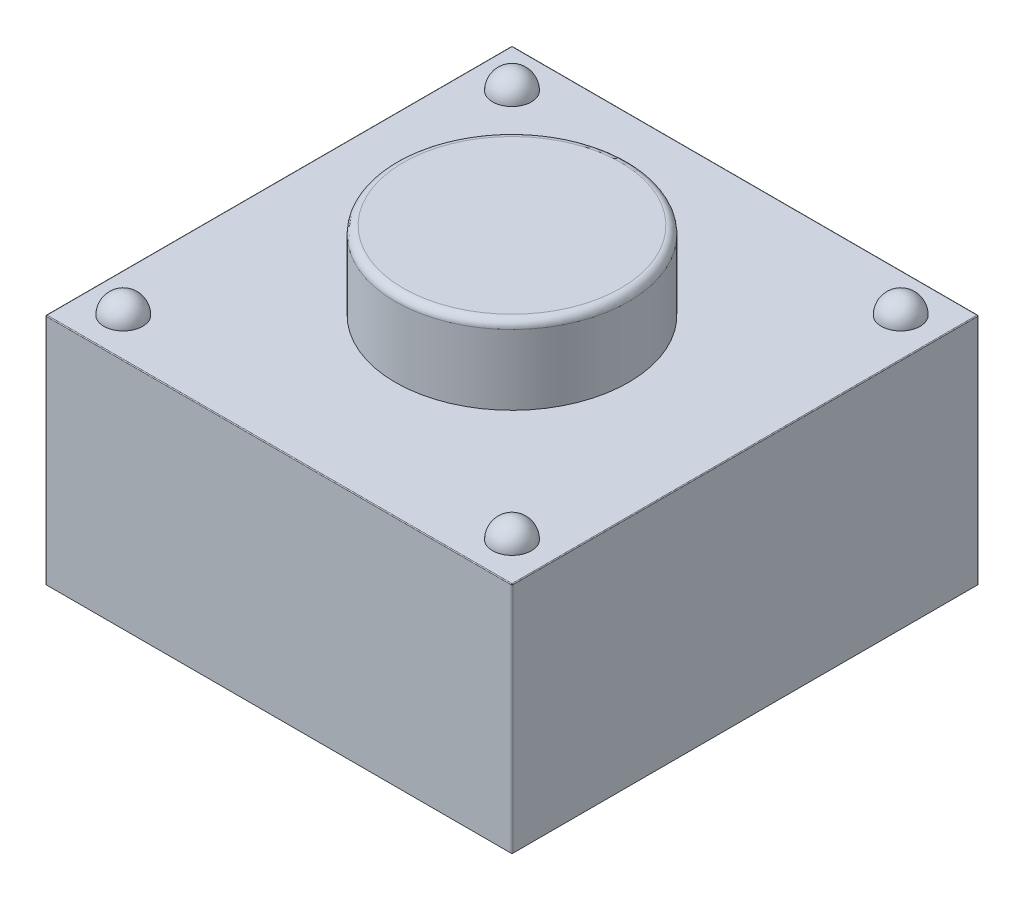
ISO-10303-21;
HEADER;
FILE_DESCRIPTION(('STEP AP214'),'2;1');
FILE_NAME('part.step','',(''),(''),'','','');
FILE_SCHEMA(('AUTOMOTIVE_DESIGN { 1 0 10303 214 1 1 1 1 }'));
ENDSEC;
DATA;
#1=APPLICATION_CONTEXT('core data for automotive mechanical design processes');
#2=APPLICATION_PROTOCOL_DEFINITION('international standard','automotive_design',2000,#1);
#3=PRODUCT_CONTEXT('',#1,'mechanical');
#4=PRODUCT('Part','Part','',(#3));
#5=PRODUCT_RELATED_PRODUCT_CATEGORY('part','',(#4));
#6=PRODUCT_DEFINITION_FORMATION('','',#4);
#7=PRODUCT_DEFINITION_CONTEXT('part definition',#1,'design');
#8=PRODUCT_DEFINITION('design','',#6,#7);
#9=PRODUCT_DEFINITION_SHAPE('','',#8);
#10=(LENGTH_UNIT() NAMED_UNIT(*) SI_UNIT(.MILLI.,.METRE.));
#11=(NAMED_UNIT(*) PLANE_ANGLE_UNIT() SI_UNIT($,.RADIAN.));
#12=(NAMED_UNIT(*) SI_UNIT($,.STERADIAN.) SOLID_ANGLE_UNIT());
#13=UNCERTAINTY_MEASURE_WITH_UNIT(LENGTH_MEASURE(1.E-05),#10,'distance_accuracy_value','');
#14=(GEOMETRIC_REPRESENTATION_CONTEXT(3) GLOBAL_UNCERTAINTY_ASSIGNED_CONTEXT((#13)) GLOBAL_UNIT_ASSIGNED_CONTEXT((#10,
#11,#12)) REPRESENTATION_CONTEXT('',''));
#15=CARTESIAN_POINT('',(0.,0.,0.));
#16=DIRECTION('',(0.,0.,1.));
#17=DIRECTION('',(1.,0.,0.));
#18=AXIS2_PLACEMENT_3D('',#15,#16,#17);
#19=CARTESIAN_POINT('',(0.,4.,0.));
#20=DIRECTION('',(0.,1.,0.));
#21=DIRECTION('',(0.,0.,1.));
#22=AXIS2_PLACEMENT_3D('',#19,#20,#21);
#23=PLANE('',#22);
#24=CARTESIAN_POINT('',(0.,4.,0.));
#25=DIRECTION('',(0.,-1.,0.));
#26=DIRECTION('',(1.,0.,0.));
#27=AXIS2_PLACEMENT_3D('',#24,#25,#26);
#28=CIRCLE('',#27,1.4);
#29=CARTESIAN_POINT('',(1.4,4.,0.));
#30=VERTEX_POINT('',#29);
#31=EDGE_CURVE('E216',#30,#30,#28,.T.);
#32=ORIENTED_EDGE('',*,*,#31,.F.);
#33=EDGE_LOOP('',(#32));
#34=FACE_BOUND('',#33,.T.);
#35=ADVANCED_FACE('F15',(#34),#23,.T.);
#36=CARTESIAN_POINT('',(0.,3.9,0.));
#37=DIRECTION('',(0.,1.,0.));
#38=DIRECTION('',(0.,0.,1.));
#39=AXIS2_PLACEMENT_3D('',#36,#37,#38);
#40=TOROIDAL_SURFACE('',#39,1.4,0.1);
#41=ORIENTED_EDGE('',*,*,#31,.T.);
#42=EDGE_LOOP('',(#41));
#43=FACE_BOUND('',#42,.T.);
#44=CARTESIAN_POINT('',(0.,3.9,0.));
#45=DIRECTION('',(0.,1.,0.));
#46=DIRECTION('',(0.,0.,1.));
#47=AXIS2_PLACEMENT_3D('',#44,#45,#46);
#48=CIRCLE('',#47,1.5);
#49=CARTESIAN_POINT('',(0.,3.9,1.5));
#50=VERTEX_POINT('',#49);
#51=EDGE_CURVE('E242',#50,#50,#48,.F.);
#52=ORIENTED_EDGE('',*,*,#51,.F.);
#53=EDGE_LOOP('',(#52));
#54=FACE_BOUND('',#53,.T.);
#55=ADVANCED_FACE('F222',(#43,#54),#40,.T.);
#56=CARTESIAN_POINT('',(0.,3.,0.));
#57=DIRECTION('',(0.,1.,0.));
#58=DIRECTION('',(0.,0.,1.));
#59=AXIS2_PLACEMENT_3D('',#56,#57,#58);
#60=CYLINDRICAL_SURFACE('',#59,1.5);
#61=ORIENTED_EDGE('',*,*,#51,.T.);
#62=EDGE_LOOP('',(#61));
#63=FACE_BOUND('',#62,.T.);
#64=CARTESIAN_POINT('',(0.,3.,0.));
#65=DIRECTION('',(0.,1.,0.));
#66=DIRECTION('',(0.,0.,1.));
#67=AXIS2_PLACEMENT_3D('',#64,#65,#66);
#68=CIRCLE('',#67,1.5);
#69=CARTESIAN_POINT('',(0.,3.,1.5));
#70=VERTEX_POINT('',#69);
#71=EDGE_CURVE('E19',#70,#70,#68,.F.);
#72=ORIENTED_EDGE('',*,*,#71,.F.);
#73=EDGE_LOOP('',(#72));
#74=FACE_BOUND('',#73,.T.);
#75=ADVANCED_FACE('F233',(#63,#74),#60,.T.);
#76=CARTESIAN_POINT('',(2.5,3.,2.5));
#77=DIRECTION('',(0.,0.,-1.));
#78=DIRECTION('',(-1.,0.,0.));
#79=AXIS2_PLACEMENT_3D('',#76,#77,#78);
#80=SPHERICAL_SURFACE('',#79,0.25);
#81=CARTESIAN_POINT('',(2.5,3.,2.5));
#82=DIRECTION('',(0.,-1.,0.));
#83=DIRECTION('',(0.,0.,-1.));
#84=AXIS2_PLACEMENT_3D('',#81,#82,#83);
#85=CIRCLE('',#84,0.25);
#86=CARTESIAN_POINT('',(2.5,3.,2.75));
#87=VERTEX_POINT('',#86);
#88=CARTESIAN_POINT('',(2.5,3.,2.25));
#89=VERTEX_POINT('',#88);
#90=EDGE_CURVE('E267',#87,#89,#85,.T.);
#91=ORIENTED_EDGE('',*,*,#90,.F.);
#92=CARTESIAN_POINT('',(2.75,3.,2.5));
#93=CARTESIAN_POINT('',(2.75001194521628,3.,2.5140645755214));
#94=CARTESIAN_POINT('',(2.74881384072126,3.,2.52812558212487));
#95=CARTESIAN_POINT('',(2.74408568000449,3.,2.55583908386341));
#96=CARTESIAN_POINT('',(2.74055745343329,3.,2.56949189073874));
#97=CARTESIAN_POINT('',(2.73125470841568,3.,2.59601727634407));
#98=CARTESIAN_POINT('',(2.72547911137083,3.,2.6088894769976));
#99=CARTESIAN_POINT('',(2.71185061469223,3.,2.63347947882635));
#100=CARTESIAN_POINT('',(2.70399808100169,3.,2.64519748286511));
#101=CARTESIAN_POINT('',(2.68643637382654,3.,2.66714997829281));
#102=CARTESIAN_POINT('',(2.67672702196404,3.,2.67738432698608));
#103=CARTESIAN_POINT('',(2.65572779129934,3.,2.69607758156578));
#104=CARTESIAN_POINT('',(2.64443793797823,3.,2.70453651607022));
#105=CARTESIAN_POINT('',(2.62059605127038,3.,2.7194410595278));
#106=CARTESIAN_POINT('',(2.60804363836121,3.,2.72588606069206));
#107=CARTESIAN_POINT('',(2.58203742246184,3.,2.73657387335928));
#108=CARTESIAN_POINT('',(2.56858415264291,3.,2.74081797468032));
#109=CARTESIAN_POINT('',(2.54587379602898,3.,2.74592878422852));
#110=CARTESIAN_POINT('',(2.53675957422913,3.,2.74745456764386));
#111=CARTESIAN_POINT('',(2.51843150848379,3.,2.74949004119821));
#112=CARTESIAN_POINT('',(2.50921782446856,3.,2.75000117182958));
#113=CARTESIAN_POINT('',(2.5,3.,2.75));
#114=B_SPLINE_CURVE_WITH_KNOTS('',3,(#92,#93,#94,#95,#96,#97,#98,#99,#100,#101,#102,#103,#104,
#105,#106,#107,#108,#109,#110,#111,#112,#113),.UNSPECIFIED.,.F.,.F.,(4,2,2,2,2,2,2,2,2,2,4),(0.,
0.042137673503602,0.0842422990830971,0.126367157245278,0.168484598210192,0.210606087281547,
0.252726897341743,0.294860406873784,0.33696919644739,0.364639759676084,0.39227101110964),.UNSPECIFIED.);
#115=CARTESIAN_POINT('',(2.75,3.,2.5));
#116=VERTEX_POINT('',#115);
#117=EDGE_CURVE('E34',#116,#87,#114,.T.);
#118=ORIENTED_EDGE('',*,*,#117,.F.);
#119=CARTESIAN_POINT('',(2.5,3.,2.5));
#120=DIRECTION('',(0.,-1.,0.));
#121=DIRECTION('',(0.,0.,-1.));
#122=AXIS2_PLACEMENT_3D('',#119,#120,#121);
#123=CIRCLE('',#122,0.25);
#124=EDGE_CURVE('E560',#89,#116,#123,.T.);
#125=ORIENTED_EDGE('',*,*,#124,.F.);
#126=EDGE_LOOP('',(#91,#118,#125));
#127=FACE_BOUND('',#126,.T.);
#128=ADVANCED_FACE('F251',(#127),#80,.T.);
#129=CARTESIAN_POINT('',(2.5,3.,-2.5));
#130=DIRECTION('',(0.,0.,-1.));
#131=DIRECTION('',(-1.,0.,0.));
#132=AXIS2_PLACEMENT_3D('',#129,#130,#131);
#133=SPHERICAL_SURFACE('',#132,0.25);
#134=CARTESIAN_POINT('',(2.5,3.,-2.5));
#135=DIRECTION('',(0.,-1.,0.));
#136=DIRECTION('',(0.,0.,-1.));
#137=AXIS2_PLACEMENT_3D('',#134,#135,#136);
#138=CIRCLE('',#137,0.25);
#139=CARTESIAN_POINT('',(2.5,3.,-2.25));
#140=VERTEX_POINT('',#139);
#141=CARTESIAN_POINT('',(2.5,3.,-2.75));
#142=VERTEX_POINT('',#141);
#143=EDGE_CURVE('E306',#140,#142,#138,.T.);
#144=ORIENTED_EDGE('',*,*,#143,.F.);
#145=CARTESIAN_POINT('',(2.75,3.,-2.5));
#146=CARTESIAN_POINT('',(2.75001194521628,3.,-2.4859354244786));
#147=CARTESIAN_POINT('',(2.74881384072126,3.,-2.47187441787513));
#148=CARTESIAN_POINT('',(2.74408568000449,3.,-2.44416091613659));
#149=CARTESIAN_POINT('',(2.74055745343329,3.,-2.43050810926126));
#150=CARTESIAN_POINT('',(2.73125470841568,3.,-2.40398272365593));
#151=CARTESIAN_POINT('',(2.72547911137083,3.,-2.3911105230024));
#152=CARTESIAN_POINT('',(2.71185061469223,3.,-2.36652052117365));
#153=CARTESIAN_POINT('',(2.70399808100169,3.,-2.35480251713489));
#154=CARTESIAN_POINT('',(2.68643637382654,3.,-2.33285002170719));
#155=CARTESIAN_POINT('',(2.67672702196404,3.,-2.32261567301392));
#156=CARTESIAN_POINT('',(2.65572779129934,3.,-2.30392241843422));
#157=CARTESIAN_POINT('',(2.64443793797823,3.,-2.29546348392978));
#158=CARTESIAN_POINT('',(2.62059605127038,3.,-2.2805589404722));
#159=CARTESIAN_POINT('',(2.60804363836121,3.,-2.27411393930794));
#160=CARTESIAN_POINT('',(2.58203742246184,3.,-2.26342612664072));
#161=CARTESIAN_POINT('',(2.56858415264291,3.,-2.25918202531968));
#162=CARTESIAN_POINT('',(2.54587379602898,3.,-2.25407121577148));
#163=CARTESIAN_POINT('',(2.53675957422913,3.,-2.25254543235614));
#164=CARTESIAN_POINT('',(2.51843150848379,3.,-2.25050995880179));
#165=CARTESIAN_POINT('',(2.50921782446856,3.,-2.24999882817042));
#166=CARTESIAN_POINT('',(2.5,3.,-2.25));
#167=B_SPLINE_CURVE_WITH_KNOTS('',3,(#145,#146,#147,#148,#149,#150,#151,#152,#153,#154,#155,
#156,#157,#158,#159,#160,#161,#162,#163,#164,#165,#166),.UNSPECIFIED.,.F.,.F.,(4,2,2,2,2,2,2,2,
2,2,4),(0.,0.042137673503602,0.0842422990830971,0.126367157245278,0.168484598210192,
0.210606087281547,0.252726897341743,0.294860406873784,0.33696919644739,0.364639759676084,
0.39227101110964),.UNSPECIFIED.);
#168=CARTESIAN_POINT('',(2.75,3.,-2.5));
#169=VERTEX_POINT('',#168);
#170=EDGE_CURVE('E300',#169,#140,#167,.T.);
#171=ORIENTED_EDGE('',*,*,#170,.F.);
#172=CARTESIAN_POINT('',(2.5,3.,-2.5));
#173=DIRECTION('',(0.,-1.,0.));
#174=DIRECTION('',(0.,0.,-1.));
#175=AXIS2_PLACEMENT_3D('',#172,#173,#174);
#176=CIRCLE('',#175,0.25);
#177=EDGE_CURVE('E266',#142,#169,#176,.T.);
#178=ORIENTED_EDGE('',*,*,#177,.F.);
#179=EDGE_LOOP('',(#144,#171,#178));
#180=FACE_BOUND('',#179,.T.);
#181=ADVANCED_FACE('F255',(#180),#133,.T.);
#182=CARTESIAN_POINT('',(-2.5,3.,2.5));
#183=DIRECTION('',(0.,0.,-1.));
#184=DIRECTION('',(-1.,0.,0.));
#185=AXIS2_PLACEMENT_3D('',#182,#183,#184);
#186=SPHERICAL_SURFACE('',#185,0.25);
#187=CARTESIAN_POINT('',(-2.5,3.,2.5));
#188=DIRECTION('',(0.,1.,0.));
#189=DIRECTION('',(0.,0.,-1.));
#190=AXIS2_PLACEMENT_3D('',#187,#188,#189);
#191=CIRCLE('',#190,0.25);
#192=CARTESIAN_POINT('',(-2.5,3.,2.25));
#193=VERTEX_POINT('',#192);
#194=CARTESIAN_POINT('',(-2.5,3.,2.75));
#195=VERTEX_POINT('',#194);
#196=EDGE_CURVE('E380',#193,#195,#191,.F.);
#197=ORIENTED_EDGE('',*,*,#196,.F.);
#198=CARTESIAN_POINT('',(-2.75,3.,2.5));
#199=CARTESIAN_POINT('',(-2.75001194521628,3.,2.4859354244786));
#200=CARTESIAN_POINT('',(-2.74881384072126,3.,2.47187441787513));
#201=CARTESIAN_POINT('',(-2.74408568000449,3.,2.44416091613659));
#202=CARTESIAN_POINT('',(-2.74055745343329,3.,2.43050810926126));
#203=CARTESIAN_POINT('',(-2.73125470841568,3.,2.40398272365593));
#204=CARTESIAN_POINT('',(-2.72547911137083,3.,2.3911105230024));
#205=CARTESIAN_POINT('',(-2.71185061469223,3.,2.36652052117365));
#206=CARTESIAN_POINT('',(-2.70399808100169,3.,2.35480251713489));
#207=CARTESIAN_POINT('',(-2.68643637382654,3.,2.33285002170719));
#208=CARTESIAN_POINT('',(-2.67672702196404,3.,2.32261567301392));
#209=CARTESIAN_POINT('',(-2.65572779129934,3.,2.30392241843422));
#210=CARTESIAN_POINT('',(-2.64443793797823,3.,2.29546348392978));
#211=CARTESIAN_POINT('',(-2.62059605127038,3.,2.2805589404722));
#212=CARTESIAN_POINT('',(-2.60804363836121,3.,2.27411393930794));
#213=CARTESIAN_POINT('',(-2.58203742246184,3.,2.26342612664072));
#214=CARTESIAN_POINT('',(-2.56858415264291,3.,2.25918202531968));
#215=CARTESIAN_POINT('',(-2.54587379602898,3.,2.25407121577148));
#216=CARTESIAN_POINT('',(-2.53675957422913,3.,2.25254543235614));
#217=CARTESIAN_POINT('',(-2.51843150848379,3.,2.25050995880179));
#218=CARTESIAN_POINT('',(-2.50921782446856,3.,2.24999882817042));
#219=CARTESIAN_POINT('',(-2.5,3.,2.25));
#220=B_SPLINE_CURVE_WITH_KNOTS('',3,(#198,#199,#200,#201,#202,#203,#204,#205,#206,#207,#208,
#209,#210,#211,#212,#213,#214,#215,#216,#217,#218,#219),.UNSPECIFIED.,.F.,.F.,(4,2,2,2,2,2,2,2,
2,2,4),(0.,0.042137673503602,0.0842422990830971,0.126367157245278,0.168484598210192,
0.210606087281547,0.252726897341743,0.294860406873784,0.33696919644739,0.364639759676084,
0.39227101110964),.UNSPECIFIED.);
#221=CARTESIAN_POINT('',(-2.75,3.,2.5));
#222=VERTEX_POINT('',#221);
#223=EDGE_CURVE('E293',#222,#193,#220,.T.);
#224=ORIENTED_EDGE('',*,*,#223,.F.);
#225=CARTESIAN_POINT('',(-2.5,3.,2.5));
#226=DIRECTION('',(0.,1.,0.));
#227=DIRECTION('',(0.,0.,-1.));
#228=AXIS2_PLACEMENT_3D('',#225,#226,#227);
#229=CIRCLE('',#228,0.25);
#230=EDGE_CURVE('E305',#195,#222,#229,.F.);
#231=ORIENTED_EDGE('',*,*,#230,.F.);
#232=EDGE_LOOP('',(#197,#224,#231));
#233=FACE_BOUND('',#232,.T.);
#234=ADVANCED_FACE('F313',(#233),#186,.T.);
#235=CARTESIAN_POINT('',(-2.5,3.,-2.5));
#236=DIRECTION('',(0.,0.,-1.));
#237=DIRECTION('',(-1.,0.,0.));
#238=AXIS2_PLACEMENT_3D('',#235,#236,#237);
#239=SPHERICAL_SURFACE('',#238,0.25);
#240=CARTESIAN_POINT('',(-2.5,3.,-2.5));
#241=DIRECTION('',(0.,1.,0.));
#242=DIRECTION('',(0.,0.,-1.));
#243=AXIS2_PLACEMENT_3D('',#240,#241,#242);
#244=CIRCLE('',#243,0.25);
#245=CARTESIAN_POINT('',(-2.5,3.,-2.75));
#246=VERTEX_POINT('',#245);
#247=CARTESIAN_POINT('',(-2.5,3.,-2.25));
#248=VERTEX_POINT('',#247);
#249=EDGE_CURVE('E378',#246,#248,#244,.F.);
#250=ORIENTED_EDGE('',*,*,#249,.F.);
#251=CARTESIAN_POINT('',(-2.75,3.,-2.5));
#252=CARTESIAN_POINT('',(-2.75001194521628,3.,-2.5140645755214));
#253=CARTESIAN_POINT('',(-2.74881384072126,3.,-2.52812558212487));
#254=CARTESIAN_POINT('',(-2.74408568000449,3.,-2.55583908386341));
#255=CARTESIAN_POINT('',(-2.74055745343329,3.,-2.56949189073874));
#256=CARTESIAN_POINT('',(-2.73125470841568,3.,-2.59601727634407));
#257=CARTESIAN_POINT('',(-2.72547911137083,3.,-2.6088894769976));
#258=CARTESIAN_POINT('',(-2.71185061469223,3.,-2.63347947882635));
#259=CARTESIAN_POINT('',(-2.70399808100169,3.,-2.64519748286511));
#260=CARTESIAN_POINT('',(-2.68643637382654,3.,-2.66714997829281));
#261=CARTESIAN_POINT('',(-2.67672702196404,3.,-2.67738432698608));
#262=CARTESIAN_POINT('',(-2.65572779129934,3.,-2.69607758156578));
#263=CARTESIAN_POINT('',(-2.64443793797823,3.,-2.70453651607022));
#264=CARTESIAN_POINT('',(-2.62059605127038,3.,-2.7194410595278));
#265=CARTESIAN_POINT('',(-2.60804363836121,3.,-2.72588606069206));
#266=CARTESIAN_POINT('',(-2.58203742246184,3.,-2.73657387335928));
#267=CARTESIAN_POINT('',(-2.56858415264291,3.,-2.74081797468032));
#268=CARTESIAN_POINT('',(-2.54587379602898,3.,-2.74592878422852));
#269=CARTESIAN_POINT('',(-2.53675957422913,3.,-2.74745456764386));
#270=CARTESIAN_POINT('',(-2.51843150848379,3.,-2.74949004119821));
#271=CARTESIAN_POINT('',(-2.50921782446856,3.,-2.75000117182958));
#272=CARTESIAN_POINT('',(-2.5,3.,-2.75));
#273=B_SPLINE_CURVE_WITH_KNOTS('',3,(#251,#252,#253,#254,#255,#256,#257,#258,#259,#260,#261,
#262,#263,#264,#265,#266,#267,#268,#269,#270,#271,#272),.UNSPECIFIED.,.F.,.F.,(4,2,2,2,2,2,2,2,
2,2,4),(0.,0.042137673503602,0.0842422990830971,0.126367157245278,0.168484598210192,
0.210606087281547,0.252726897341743,0.294860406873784,0.33696919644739,0.364639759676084,
0.39227101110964),.UNSPECIFIED.);
#274=CARTESIAN_POINT('',(-2.75,3.,-2.5));
#275=VERTEX_POINT('',#274);
#276=EDGE_CURVE('E284',#275,#246,#273,.T.);
#277=ORIENTED_EDGE('',*,*,#276,.F.);
#278=CARTESIAN_POINT('',(-2.5,3.,-2.5));
#279=DIRECTION('',(0.,1.,0.));
#280=DIRECTION('',(0.,0.,-1.));
#281=AXIS2_PLACEMENT_3D('',#278,#279,#280);
#282=CIRCLE('',#281,0.25);
#283=EDGE_CURVE('E379',#248,#275,#282,.F.);
#284=ORIENTED_EDGE('',*,*,#283,.F.);
#285=EDGE_LOOP('',(#250,#277,#284));
#286=FACE_BOUND('',#285,.T.);
#287=ADVANCED_FACE('F140',(#286),#239,.T.);
#288=CARTESIAN_POINT('',(-2.99,2.99,2.99));
#289=DIRECTION('',(-0.577350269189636,0.577350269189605,0.577350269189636));
#290=DIRECTION('',(-0.707106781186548,0.,-0.707106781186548));
#291=AXIS2_PLACEMENT_3D('',#288,#289,#290);
#292=SPHERICAL_SURFACE('',#291,0.01);
#293=CARTESIAN_POINT('',(-2.9957735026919,2.9957735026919,2.9957735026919));
#294=VERTEX_POINT('',#293);
#295=VERTEX_LOOP('',#294);
#296=FACE_BOUND('',#295,.T.);
#297=CARTESIAN_POINT('',(-2.99,2.99,2.99));
#298=DIRECTION('',(0.,1.,0.));
#299=DIRECTION('',(0.,0.,1.));
#300=AXIS2_PLACEMENT_3D('',#297,#298,#299);
#301=CIRCLE('',#300,0.01);
#302=CARTESIAN_POINT('',(-2.99,2.99,3.));
#303=VERTEX_POINT('',#302);
#304=CARTESIAN_POINT('',(-3.,2.99,2.99));
#305=VERTEX_POINT('',#304);
#306=EDGE_CURVE('E145',#303,#305,#301,.F.);
#307=ORIENTED_EDGE('',*,*,#306,.F.);
#308=CARTESIAN_POINT('',(-2.99,2.99,2.99));
#309=DIRECTION('',(1.,0.,0.));
#310=DIRECTION('',(0.,0.,-1.));
#311=AXIS2_PLACEMENT_3D('',#308,#309,#310);
#312=CIRCLE('',#311,0.01);
#313=CARTESIAN_POINT('',(-2.99,3.,2.99));
#314=VERTEX_POINT('',#313);
#315=EDGE_CURVE('E147',#314,#303,#312,.T.);
#316=ORIENTED_EDGE('',*,*,#315,.F.);
#317=CARTESIAN_POINT('',(-2.99,2.99,2.99));
#318=DIRECTION('',(0.,0.,1.));
#319=DIRECTION('',(1.,0.,0.));
#320=AXIS2_PLACEMENT_3D('',#317,#318,#319);
#321=CIRCLE('',#320,0.01);
#322=EDGE_CURVE('E149',#305,#314,#321,.F.);
#323=ORIENTED_EDGE('',*,*,#322,.F.);
#324=EDGE_LOOP('',(#307,#316,#323));
#325=FACE_BOUND('',#324,.T.);
#326=ADVANCED_FACE('F136',(#296,#325),#292,.T.);
#327=CARTESIAN_POINT('',(2.99,2.99,2.99));
#328=DIRECTION('',(0.577350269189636,0.577350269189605,0.577350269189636));
#329=DIRECTION('',(-0.707106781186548,0.,0.707106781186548));
#330=AXIS2_PLACEMENT_3D('',#327,#328,#329);
#331=SPHERICAL_SURFACE('',#330,0.01);
#332=CARTESIAN_POINT('',(2.9957735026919,2.9957735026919,2.9957735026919));
#333=VERTEX_POINT('',#332);
#334=VERTEX_LOOP('',#333);
#335=FACE_BOUND('',#334,.T.);
#336=CARTESIAN_POINT('',(2.99,2.99,2.99));
#337=DIRECTION('',(0.,1.,0.));
#338=DIRECTION('',(0.,0.,1.));
#339=AXIS2_PLACEMENT_3D('',#336,#337,#338);
#340=CIRCLE('',#339,0.01);
#341=CARTESIAN_POINT('',(3.,2.99,2.99));
#342=VERTEX_POINT('',#341);
#343=CARTESIAN_POINT('',(2.99,2.99,3.));
#344=VERTEX_POINT('',#343);
#345=EDGE_CURVE('E394',#342,#344,#340,.F.);
#346=ORIENTED_EDGE('',*,*,#345,.F.);
#347=CARTESIAN_POINT('',(2.99,2.99,2.99));
#348=DIRECTION('',(0.,0.,-1.));
#349=DIRECTION('',(-1.,0.,0.));
#350=AXIS2_PLACEMENT_3D('',#347,#348,#349);
#351=CIRCLE('',#350,0.01);
#352=CARTESIAN_POINT('',(2.99,3.,2.99));
#353=VERTEX_POINT('',#352);
#354=EDGE_CURVE('E205',#353,#342,#351,.T.);
#355=ORIENTED_EDGE('',*,*,#354,.F.);
#356=CARTESIAN_POINT('',(2.99,2.99,2.99));
#357=DIRECTION('',(1.,0.,0.));
#358=DIRECTION('',(0.,0.,-1.));
#359=AXIS2_PLACEMENT_3D('',#356,#357,#358);
#360=CIRCLE('',#359,0.01);
#361=EDGE_CURVE('E155',#344,#353,#360,.F.);
#362=ORIENTED_EDGE('',*,*,#361,.F.);
#363=EDGE_LOOP('',(#346,#355,#362));
#364=FACE_BOUND('',#363,.T.);
#365=ADVANCED_FACE('F139',(#335,#364),#331,.T.);
#366=CARTESIAN_POINT('',(-2.99,2.99,-2.99));
#367=DIRECTION('',(-0.577350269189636,0.577350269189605,-0.577350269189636));
#368=DIRECTION('',(0.707106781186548,0.,-0.707106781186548));
#369=AXIS2_PLACEMENT_3D('',#366,#367,#368);
#370=SPHERICAL_SURFACE('',#369,0.01);
#371=CARTESIAN_POINT('',(-2.9957735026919,2.9957735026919,-2.9957735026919));
#372=VERTEX_POINT('',#371);
#373=VERTEX_LOOP('',#372);
#374=FACE_BOUND('',#373,.T.);
#375=CARTESIAN_POINT('',(-2.99,2.99,-2.99));
#376=DIRECTION('',(0.,1.,0.));
#377=DIRECTION('',(0.,0.,1.));
#378=AXIS2_PLACEMENT_3D('',#375,#376,#377);
#379=CIRCLE('',#378,0.01);
#380=CARTESIAN_POINT('',(-3.,2.99,-2.99));
#381=VERTEX_POINT('',#380);
#382=CARTESIAN_POINT('',(-2.99,2.99,-3.));
#383=VERTEX_POINT('',#382);
#384=EDGE_CURVE('E397',#381,#383,#379,.F.);
#385=ORIENTED_EDGE('',*,*,#384,.F.);
#386=CARTESIAN_POINT('',(-2.99,2.99,-2.99));
#387=DIRECTION('',(0.,0.,1.));
#388=DIRECTION('',(1.,0.,0.));
#389=AXIS2_PLACEMENT_3D('',#386,#387,#388);
#390=CIRCLE('',#389,0.01);
#391=CARTESIAN_POINT('',(-2.99,3.,-2.99));
#392=VERTEX_POINT('',#391);
#393=EDGE_CURVE('E211',#392,#381,#390,.T.);
#394=ORIENTED_EDGE('',*,*,#393,.F.);
#395=CARTESIAN_POINT('',(-2.99,2.99,-2.99));
#396=DIRECTION('',(-1.,0.,0.));
#397=DIRECTION('',(0.,0.,1.));
#398=AXIS2_PLACEMENT_3D('',#395,#396,#397);
#399=CIRCLE('',#398,0.01);
#400=EDGE_CURVE('E201',#383,#392,#399,.F.);
#401=ORIENTED_EDGE('',*,*,#400,.F.);
#402=EDGE_LOOP('',(#385,#394,#401));
#403=FACE_BOUND('',#402,.T.);
#404=ADVANCED_FACE('F275',(#374,#403),#370,.T.);
#405=CARTESIAN_POINT('',(0.,3.,0.));
#406=DIRECTION('',(0.,1.,0.));
#407=DIRECTION('',(0.,0.,1.));
#408=AXIS2_PLACEMENT_3D('',#405,#406,#407);
#409=PLANE('',#408);
#410=ORIENTED_EDGE('',*,*,#276,.T.);
#411=ORIENTED_EDGE('',*,*,#249,.T.);
#412=ORIENTED_EDGE('',*,*,#283,.T.);
#413=EDGE_LOOP('',(#410,#411,#412));
#414=FACE_BOUND('',#413,.T.);
#415=ORIENTED_EDGE('',*,*,#223,.T.);
#416=ORIENTED_EDGE('',*,*,#196,.T.);
#417=ORIENTED_EDGE('',*,*,#230,.T.);
#418=EDGE_LOOP('',(#415,#416,#417));
#419=FACE_BOUND('',#418,.T.);
#420=ORIENTED_EDGE('',*,*,#170,.T.);
#421=ORIENTED_EDGE('',*,*,#143,.T.);
#422=ORIENTED_EDGE('',*,*,#177,.T.);
#423=EDGE_LOOP('',(#420,#421,#422));
#424=FACE_BOUND('',#423,.T.);
#425=ORIENTED_EDGE('',*,*,#117,.T.);
#426=ORIENTED_EDGE('',*,*,#90,.T.);
#427=ORIENTED_EDGE('',*,*,#124,.T.);
#428=EDGE_LOOP('',(#425,#426,#427));
#429=FACE_BOUND('',#428,.T.);
#430=ORIENTED_EDGE('',*,*,#71,.T.);
#431=EDGE_LOOP('',(#430));
#432=FACE_BOUND('',#431,.T.);
#433=DIRECTION('',(1.,0.,0.));
#434=VECTOR('',#433,1.);
#435=CARTESIAN_POINT('',(-1.5,3.,2.99));
#436=LINE('',#435,#434);
#437=EDGE_CURVE('E207',#353,#314,#436,.F.);
#438=ORIENTED_EDGE('',*,*,#437,.F.);
#439=DIRECTION('',(0.,0.,-1.));
#440=VECTOR('',#439,1.);
#441=CARTESIAN_POINT('',(2.99,3.,1.5));
#442=LINE('',#441,#440);
#443=CARTESIAN_POINT('',(2.99,3.,-2.99));
#444=VERTEX_POINT('',#443);
#445=EDGE_CURVE('E202',#444,#353,#442,.F.);
#446=ORIENTED_EDGE('',*,*,#445,.F.);
#447=DIRECTION('',(-1.,0.,0.));
#448=VECTOR('',#447,1.);
#449=CARTESIAN_POINT('',(1.5,3.,-2.99));
#450=LINE('',#449,#448);
#451=EDGE_CURVE('E197',#392,#444,#450,.F.);
#452=ORIENTED_EDGE('',*,*,#451,.F.);
#453=DIRECTION('',(0.,0.,1.));
#454=VECTOR('',#453,1.);
#455=CARTESIAN_POINT('',(-2.99,3.,-1.5));
#456=LINE('',#455,#454);
#457=EDGE_CURVE('E209',#314,#392,#456,.F.);
#458=ORIENTED_EDGE('',*,*,#457,.F.);
#459=EDGE_LOOP('',(#438,#446,#452,#458));
#460=FACE_BOUND('',#459,.T.);
#461=ADVANCED_FACE('F269',(#414,#419,#424,#429,#432,#460),#409,.T.);
#462=CARTESIAN_POINT('',(2.99,2.99,-2.99));
#463=DIRECTION('',(0.577350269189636,0.577350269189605,-0.577350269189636));
#464=DIRECTION('',(0.707106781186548,0.,0.707106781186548));
#465=AXIS2_PLACEMENT_3D('',#462,#463,#464);
#466=SPHERICAL_SURFACE('',#465,0.01);
#467=CARTESIAN_POINT('',(2.9957735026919,2.9957735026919,-2.9957735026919));
#468=VERTEX_POINT('',#467);
#469=VERTEX_LOOP('',#468);
#470=FACE_BOUND('',#469,.T.);
#471=CARTESIAN_POINT('',(2.99,2.99,-2.99));
#472=DIRECTION('',(0.,1.,0.));
#473=DIRECTION('',(0.,0.,1.));
#474=AXIS2_PLACEMENT_3D('',#471,#472,#473);
#475=CIRCLE('',#474,0.01);
#476=CARTESIAN_POINT('',(2.99,2.99,-3.));
#477=VERTEX_POINT('',#476);
#478=CARTESIAN_POINT('',(3.,2.99,-2.99));
#479=VERTEX_POINT('',#478);
#480=EDGE_CURVE('E186',#477,#479,#475,.F.);
#481=ORIENTED_EDGE('',*,*,#480,.F.);
#482=CARTESIAN_POINT('',(2.99,2.99,-2.99));
#483=DIRECTION('',(-1.,0.,0.));
#484=DIRECTION('',(0.,0.,1.));
#485=AXIS2_PLACEMENT_3D('',#482,#483,#484);
#486=CIRCLE('',#485,0.01);
#487=EDGE_CURVE('E200',#444,#477,#486,.T.);
#488=ORIENTED_EDGE('',*,*,#487,.F.);
#489=CARTESIAN_POINT('',(2.99,2.99,-2.99));
#490=DIRECTION('',(0.,0.,-1.));
#491=DIRECTION('',(-1.,0.,0.));
#492=AXIS2_PLACEMENT_3D('',#489,#490,#491);
#493=CIRCLE('',#492,0.01);
#494=EDGE_CURVE('E206',#479,#444,#493,.F.);
#495=ORIENTED_EDGE('',*,*,#494,.F.);
#496=EDGE_LOOP('',(#481,#488,#495));
#497=FACE_BOUND('',#496,.T.);
#498=ADVANCED_FACE('F274',(#470,#497),#466,.T.);
#499=CARTESIAN_POINT('',(-2.99,2.99,-1.5));
#500=DIRECTION('',(0.,0.,1.));
#501=DIRECTION('',(1.,0.,0.));
#502=AXIS2_PLACEMENT_3D('',#499,#500,#501);
#503=CYLINDRICAL_SURFACE('',#502,0.01);
#504=ORIENTED_EDGE('',*,*,#393,.T.);
#505=DIRECTION('',(0.,0.,1.));
#506=VECTOR('',#505,1.);
#507=CARTESIAN_POINT('',(-3.,2.99,-3.));
#508=LINE('',#507,#506);
#509=EDGE_CURVE('E174',#305,#381,#508,.F.);
#510=ORIENTED_EDGE('',*,*,#509,.F.);
#511=ORIENTED_EDGE('',*,*,#322,.T.);
#512=ORIENTED_EDGE('',*,*,#457,.T.);
#513=EDGE_LOOP('',(#504,#510,#511,#512));
#514=FACE_BOUND('',#513,.T.);
#515=ADVANCED_FACE('F433',(#514),#503,.T.);
#516=CARTESIAN_POINT('',(-2.99,0.,2.99));
#517=DIRECTION('',(0.,1.,0.));
#518=DIRECTION('',(0.,0.,1.));
#519=AXIS2_PLACEMENT_3D('',#516,#517,#518);
#520=CYLINDRICAL_SURFACE('',#519,0.01);
#521=ORIENTED_EDGE('',*,*,#306,.T.);
#522=DIRECTION('',(0.,1.,0.));
#523=VECTOR('',#522,1.);
#524=CARTESIAN_POINT('',(-3.,0.,2.99));
#525=LINE('',#524,#523);
#526=CARTESIAN_POINT('',(-3.,0.,2.99));
#527=VERTEX_POINT('',#526);
#528=EDGE_CURVE('E178',#527,#305,#525,.T.);
#529=ORIENTED_EDGE('',*,*,#528,.F.);
#530=CARTESIAN_POINT('',(-2.99,0.,2.99));
#531=DIRECTION('',(0.,1.,0.));
#532=DIRECTION('',(0.,0.,1.));
#533=AXIS2_PLACEMENT_3D('',#530,#531,#532);
#534=CIRCLE('',#533,0.01);
#535=CARTESIAN_POINT('',(-2.99,0.,3.));
#536=VERTEX_POINT('',#535);
#537=EDGE_CURVE('E156',#527,#536,#534,.T.);
#538=ORIENTED_EDGE('',*,*,#537,.T.);
#539=DIRECTION('',(0.,1.,0.));
#540=VECTOR('',#539,1.);
#541=CARTESIAN_POINT('',(-2.99,0.,3.));
#542=LINE('',#541,#540);
#543=EDGE_CURVE('E165',#303,#536,#542,.F.);
#544=ORIENTED_EDGE('',*,*,#543,.F.);
#545=EDGE_LOOP('',(#521,#529,#538,#544));
#546=FACE_BOUND('',#545,.T.);
#547=ADVANCED_FACE('F173',(#546),#520,.T.);
#548=CARTESIAN_POINT('',(-1.5,2.99,2.99));
#549=DIRECTION('',(1.,0.,0.));
#550=DIRECTION('',(0.,0.,-1.));
#551=AXIS2_PLACEMENT_3D('',#548,#549,#550);
#552=CYLINDRICAL_SURFACE('',#551,0.01);
#553=ORIENTED_EDGE('',*,*,#315,.T.);
#554=DIRECTION('',(1.,0.,0.));
#555=VECTOR('',#554,1.);
#556=CARTESIAN_POINT('',(-3.,2.99,3.));
#557=LINE('',#556,#555);
#558=EDGE_CURVE('E162',#344,#303,#557,.F.);
#559=ORIENTED_EDGE('',*,*,#558,.F.);
#560=ORIENTED_EDGE('',*,*,#361,.T.);
#561=ORIENTED_EDGE('',*,*,#437,.T.);
#562=EDGE_LOOP('',(#553,#559,#560,#561));
#563=FACE_BOUND('',#562,.T.);
#564=ADVANCED_FACE('F425',(#563),#552,.T.);
#565=CARTESIAN_POINT('',(2.99,2.99,1.5));
#566=DIRECTION('',(0.,0.,-1.));
#567=DIRECTION('',(-1.,0.,0.));
#568=AXIS2_PLACEMENT_3D('',#565,#566,#567);
#569=CYLINDRICAL_SURFACE('',#568,0.01);
#570=ORIENTED_EDGE('',*,*,#354,.T.);
#571=DIRECTION('',(0.,0.,-1.));
#572=VECTOR('',#571,1.);
#573=CARTESIAN_POINT('',(3.,2.99,3.));
#574=LINE('',#573,#572);
#575=EDGE_CURVE('E193',#479,#342,#574,.F.);
#576=ORIENTED_EDGE('',*,*,#575,.F.);
#577=ORIENTED_EDGE('',*,*,#494,.T.);
#578=ORIENTED_EDGE('',*,*,#445,.T.);
#579=EDGE_LOOP('',(#570,#576,#577,#578));
#580=FACE_BOUND('',#579,.T.);
#581=ADVANCED_FACE('F406',(#580),#569,.T.);
#582=CARTESIAN_POINT('',(2.99,0.,2.99));
#583=DIRECTION('',(0.,1.,0.));
#584=DIRECTION('',(0.,0.,1.));
#585=AXIS2_PLACEMENT_3D('',#582,#583,#584);
#586=CYLINDRICAL_SURFACE('',#585,0.01);
#587=ORIENTED_EDGE('',*,*,#345,.T.);
#588=DIRECTION('',(0.,1.,0.));
#589=VECTOR('',#588,1.);
#590=CARTESIAN_POINT('',(2.99,0.,3.));
#591=LINE('',#590,#589);
#592=CARTESIAN_POINT('',(2.99,0.,3.));
#593=VERTEX_POINT('',#592);
#594=EDGE_CURVE('E168',#593,#344,#591,.T.);
#595=ORIENTED_EDGE('',*,*,#594,.F.);
#596=CARTESIAN_POINT('',(2.99,0.,2.99));
#597=DIRECTION('',(0.,1.,0.));
#598=DIRECTION('',(0.,0.,1.));
#599=AXIS2_PLACEMENT_3D('',#596,#597,#598);
#600=CIRCLE('',#599,0.01);
#601=CARTESIAN_POINT('',(3.,0.,2.99));
#602=VERTEX_POINT('',#601);
#603=EDGE_CURVE('E356',#593,#602,#600,.T.);
#604=ORIENTED_EDGE('',*,*,#603,.T.);
#605=DIRECTION('',(0.,1.,0.));
#606=VECTOR('',#605,1.);
#607=CARTESIAN_POINT('',(3.,0.,2.99));
#608=LINE('',#607,#606);
#609=EDGE_CURVE('E195',#342,#602,#608,.F.);
#610=ORIENTED_EDGE('',*,*,#609,.F.);
#611=EDGE_LOOP('',(#587,#595,#604,#610));
#612=FACE_BOUND('',#611,.T.);
#613=ADVANCED_FACE('F411',(#612),#586,.T.);
#614=CARTESIAN_POINT('',(-2.99,0.,-2.99));
#615=DIRECTION('',(0.,1.,0.));
#616=DIRECTION('',(0.,0.,1.));
#617=AXIS2_PLACEMENT_3D('',#614,#615,#616);
#618=CYLINDRICAL_SURFACE('',#617,0.01);
#619=ORIENTED_EDGE('',*,*,#384,.T.);
#620=DIRECTION('',(0.,1.,0.));
#621=VECTOR('',#620,1.);
#622=CARTESIAN_POINT('',(-2.99,0.,-3.));
#623=LINE('',#622,#621);
#624=CARTESIAN_POINT('',(-2.99,0.,-3.));
#625=VERTEX_POINT('',#624);
#626=EDGE_CURVE('E192',#625,#383,#623,.T.);
#627=ORIENTED_EDGE('',*,*,#626,.F.);
#628=CARTESIAN_POINT('',(-2.99,0.,-2.99));
#629=DIRECTION('',(0.,1.,0.));
#630=DIRECTION('',(0.,0.,1.));
#631=AXIS2_PLACEMENT_3D('',#628,#629,#630);
#632=CIRCLE('',#631,0.01);
#633=CARTESIAN_POINT('',(-3.,0.,-2.99));
#634=VERTEX_POINT('',#633);
#635=EDGE_CURVE('E332',#625,#634,#632,.T.);
#636=ORIENTED_EDGE('',*,*,#635,.T.);
#637=DIRECTION('',(0.,1.,0.));
#638=VECTOR('',#637,1.);
#639=CARTESIAN_POINT('',(-3.,0.,-2.99));
#640=LINE('',#639,#638);
#641=EDGE_CURVE('E183',#381,#634,#640,.F.);
#642=ORIENTED_EDGE('',*,*,#641,.F.);
#643=EDGE_LOOP('',(#619,#627,#636,#642));
#644=FACE_BOUND('',#643,.T.);
#645=ADVANCED_FACE('F416',(#644),#618,.T.);
#646=CARTESIAN_POINT('',(1.5,2.99,-2.99));
#647=DIRECTION('',(-1.,0.,0.));
#648=DIRECTION('',(0.,0.,1.));
#649=AXIS2_PLACEMENT_3D('',#646,#647,#648);
#650=CYLINDRICAL_SURFACE('',#649,0.01);
#651=ORIENTED_EDGE('',*,*,#487,.T.);
#652=DIRECTION('',(-1.,0.,0.));
#653=VECTOR('',#652,1.);
#654=CARTESIAN_POINT('',(3.,2.99,-3.));
#655=LINE('',#654,#653);
#656=EDGE_CURVE('E188',#383,#477,#655,.F.);
#657=ORIENTED_EDGE('',*,*,#656,.F.);
#658=ORIENTED_EDGE('',*,*,#400,.T.);
#659=ORIENTED_EDGE('',*,*,#451,.T.);
#660=EDGE_LOOP('',(#651,#657,#658,#659));
#661=FACE_BOUND('',#660,.T.);
#662=ADVANCED_FACE('F421',(#661),#650,.T.);
#663=CARTESIAN_POINT('',(2.99,0.,-2.99));
#664=DIRECTION('',(0.,1.,0.));
#665=DIRECTION('',(0.,0.,1.));
#666=AXIS2_PLACEMENT_3D('',#663,#664,#665);
#667=CYLINDRICAL_SURFACE('',#666,0.01);
#668=ORIENTED_EDGE('',*,*,#480,.T.);
#669=DIRECTION('',(0.,1.,0.));
#670=VECTOR('',#669,1.);
#671=CARTESIAN_POINT('',(3.,0.,-2.99));
#672=LINE('',#671,#670);
#673=CARTESIAN_POINT('',(3.,0.,-2.99));
#674=VERTEX_POINT('',#673);
#675=EDGE_CURVE('E171',#674,#479,#672,.T.);
#676=ORIENTED_EDGE('',*,*,#675,.F.);
#677=CARTESIAN_POINT('',(2.99,0.,-2.99));
#678=DIRECTION('',(0.,1.,0.));
#679=DIRECTION('',(0.,0.,1.));
#680=AXIS2_PLACEMENT_3D('',#677,#678,#679);
#681=CIRCLE('',#680,0.01);
#682=CARTESIAN_POINT('',(2.99,0.,-3.));
#683=VERTEX_POINT('',#682);
#684=EDGE_CURVE('E329',#674,#683,#681,.T.);
#685=ORIENTED_EDGE('',*,*,#684,.T.);
#686=DIRECTION('',(0.,1.,0.));
#687=VECTOR('',#686,1.);
#688=CARTESIAN_POINT('',(2.99,0.,-3.));
#689=LINE('',#688,#687);
#690=EDGE_CURVE('E191',#477,#683,#689,.F.);
#691=ORIENTED_EDGE('',*,*,#690,.F.);
#692=EDGE_LOOP('',(#668,#676,#685,#691));
#693=FACE_BOUND('',#692,.T.);
#694=ADVANCED_FACE('F401',(#693),#667,.T.);
#695=CARTESIAN_POINT('',(-3.,0.,-3.));
#696=DIRECTION('',(-1.,0.,0.));
#697=DIRECTION('',(0.,0.,1.));
#698=AXIS2_PLACEMENT_3D('',#695,#696,#697);
#699=PLANE('',#698);
#700=ORIENTED_EDGE('',*,*,#528,.T.);
#701=ORIENTED_EDGE('',*,*,#509,.T.);
#702=ORIENTED_EDGE('',*,*,#641,.T.);
#703=DIRECTION('',(0.,0.,1.));
#704=VECTOR('',#703,1.);
#705=CARTESIAN_POINT('',(-3.,0.,0.));
#706=LINE('',#705,#704);
#707=EDGE_CURVE('E341',#634,#527,#706,.T.);
#708=ORIENTED_EDGE('',*,*,#707,.T.);
#709=EDGE_LOOP('',(#700,#701,#702,#708));
#710=FACE_BOUND('',#709,.T.);
#711=ADVANCED_FACE('F413',(#710),#699,.T.);
#712=CARTESIAN_POINT('',(-3.,0.,3.));
#713=DIRECTION('',(0.,0.,1.));
#714=DIRECTION('',(1.,0.,0.));
#715=AXIS2_PLACEMENT_3D('',#712,#713,#714);
#716=PLANE('',#715);
#717=ORIENTED_EDGE('',*,*,#594,.T.);
#718=ORIENTED_EDGE('',*,*,#558,.T.);
#719=ORIENTED_EDGE('',*,*,#543,.T.);
#720=DIRECTION('',(1.,0.,0.));
#721=VECTOR('',#720,1.);
#722=CARTESIAN_POINT('',(0.,0.,3.));
#723=LINE('',#722,#721);
#724=EDGE_CURVE('E344',#536,#593,#723,.T.);
#725=ORIENTED_EDGE('',*,*,#724,.T.);
#726=EDGE_LOOP('',(#717,#718,#719,#725));
#727=FACE_BOUND('',#726,.T.);
#728=ADVANCED_FACE('F163',(#727),#716,.T.);
#729=CARTESIAN_POINT('',(3.,0.,3.));
#730=DIRECTION('',(1.,0.,0.));
#731=DIRECTION('',(0.,0.,-1.));
#732=AXIS2_PLACEMENT_3D('',#729,#730,#731);
#733=PLANE('',#732);
#734=ORIENTED_EDGE('',*,*,#609,.T.);
#735=DIRECTION('',(0.,0.,1.));
#736=VECTOR('',#735,1.);
#737=CARTESIAN_POINT('',(3.,0.,0.));
#738=LINE('',#737,#736);
#739=EDGE_CURVE('E25',#602,#674,#738,.F.);
#740=ORIENTED_EDGE('',*,*,#739,.T.);
#741=ORIENTED_EDGE('',*,*,#675,.T.);
#742=ORIENTED_EDGE('',*,*,#575,.T.);
#743=EDGE_LOOP('',(#734,#740,#741,#742));
#744=FACE_BOUND('',#743,.T.);
#745=ADVANCED_FACE('F325',(#744),#733,.T.);
#746=CARTESIAN_POINT('',(3.,0.,-3.));
#747=DIRECTION('',(0.,0.,-1.));
#748=DIRECTION('',(-1.,0.,0.));
#749=AXIS2_PLACEMENT_3D('',#746,#747,#748);
#750=PLANE('',#749);
#751=ORIENTED_EDGE('',*,*,#690,.T.);
#752=DIRECTION('',(1.,0.,0.));
#753=VECTOR('',#752,1.);
#754=CARTESIAN_POINT('',(0.,0.,-3.));
#755=LINE('',#754,#753);
#756=EDGE_CURVE('E10',#683,#625,#755,.F.);
#757=ORIENTED_EDGE('',*,*,#756,.T.);
#758=ORIENTED_EDGE('',*,*,#626,.T.);
#759=ORIENTED_EDGE('',*,*,#656,.T.);
#760=EDGE_LOOP('',(#751,#757,#758,#759));
#761=FACE_BOUND('',#760,.T.);
#762=ADVANCED_FACE('F320',(#761),#750,.T.);
#763=CARTESIAN_POINT('',(0.,0.,0.));
#764=DIRECTION('',(0.,1.,0.));
#765=DIRECTION('',(0.,0.,1.));
#766=AXIS2_PLACEMENT_3D('',#763,#764,#765);
#767=PLANE('',#766);
#768=ORIENTED_EDGE('',*,*,#756,.F.);
#769=ORIENTED_EDGE('',*,*,#684,.F.);
#770=ORIENTED_EDGE('',*,*,#739,.F.);
#771=ORIENTED_EDGE('',*,*,#603,.F.);
#772=ORIENTED_EDGE('',*,*,#724,.F.);
#773=ORIENTED_EDGE('',*,*,#537,.F.);
#774=ORIENTED_EDGE('',*,*,#707,.F.);
#775=ORIENTED_EDGE('',*,*,#635,.F.);
#776=EDGE_LOOP('',(#768,#769,#770,#771,#772,#773,#774,#775));
#777=FACE_BOUND('',#776,.T.);
#778=ADVANCED_FACE('F17',(#777),#767,.F.);
#779=CLOSED_SHELL('',(#35,#55,#75,#128,#181,#234,#287,#326,#365,#404,#461,#498,#515,#547,#564,
#581,#613,#645,#662,#694,#711,#728,#745,#762,#778));
#780=MANIFOLD_SOLID_BREP('B1',#779);
#781=ADVANCED_BREP_SHAPE_REPRESENTATION('',(#18,#780),#14);
#782=SHAPE_DEFINITION_REPRESENTATION(#9,#781);
ENDSEC;
END-ISO-10303-21;
